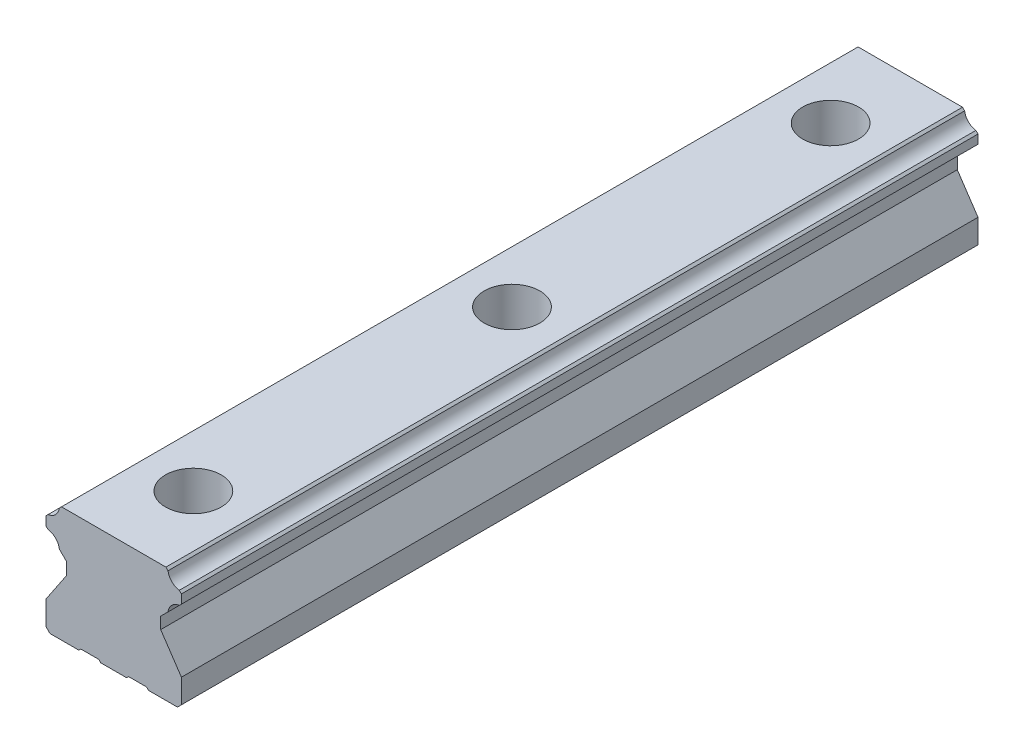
from build123d import *

# Parameters (mm, degrees)
BOSS_EXTRUDE1_DEPTH                                 = 200
CBORE_FOR_M8_HEX_SOCKET_HEAD_CAP_SCREW1_D           = 9
CBORE_FOR_M8_HEX_SOCKET_HEAD_CAP_SCREW1_CBORE_D     = 14
CBORE_FOR_M8_HEX_SOCKET_HEAD_CAP_SCREW1_CBORE_DEPTH = 12
LPATTERN1_COUNT                                     = 3
LPATTERN1_PITCH                                     = 80


with BuildPart() as part:
    # Sketch1 → Boss-Extrude1 (new body)
    with BuildSketch(Plane.XY):
        with BuildLine():
            Line((16.470618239, 25.639381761), (17, 25.11))
            Line((17, 25.11), (17, 22.88))
            Line((17, 22.88), (16.482146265, 22.362146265))
            ThreePointArc((16.482146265, 22.362146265), (14.576547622, 21.423452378), (13.637853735, 19.517853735))
            Line((13.637853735, 19.517853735), (11.8, 17.68))
            Line((11.8, 17.68), (11.8, 14.75))
            Line((11.8, 14.75), (17, 7))
            Line((17, 7), (17, 1))
            Line((17, 1), (16, 0))
            Line((16, 0), (8.75, 0))
            Line((8.75, 0), (8.25, 0.5))
            Line((8.25, 0.5), (3.75, 0.5))
            Line((3.75, 0.5), (3.25, 0))
            Line((3.25, 0), (-3.25, 0))
            Line((-3.25, 0), (-3.75, 0.5))
            Line((-3.75, 0.5), (-8.25, 0.5))
            Line((-8.25, 0.5), (-8.75, 0))
            Line((-8.75, 0), (-16, 0))
            Line((-16, 0), (-17, 1))
            Line((-17, 1), (-17, 7))
            Line((-17, 7), (-11.8, 14.75))
            Line((-11.8, 14.75), (-11.8, 17.68))
            Line((-11.8, 17.68), (-13.637853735, 19.517853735))
            ThreePointArc((-13.637853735, 19.517853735), (-14.576547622, 21.423452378), (-16.482146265, 22.362146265))
            Line((-16.482146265, 22.362146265), (-17, 22.88))
            Line((-17, 22.88), (-17, 25.11))
            Line((-17, 25.11), (-16.470618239, 25.639381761))
            ThreePointArc((-16.470618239, 25.639381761), (-14.576547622, 26.576547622), (-13.639381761, 28.470618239))
            Line((-13.639381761, 28.470618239), (-13.11, 29))
            Line((-13.11, 29), (13.11, 29))
            Line((13.11, 29), (13.639381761, 28.470618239))
            ThreePointArc((13.639381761, 28.470618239), (14.576547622, 26.576547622), (16.470618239, 25.639381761))
        make_face()
    extrude(amount=-BOSS_EXTRUDE1_DEPTH)

    # CBORE for M8 Hex Socket Head Cap Screw1 (through all)
    with Locations(Plane(origin=(0, 29, 0), x_dir=(1, 0, 0), z_dir=(0, 1, 0))):
        with Locations((0, 20)):
            cbore_for_m8_hex_socket_head_cap_screw1 = CounterBoreHole(CBORE_FOR_M8_HEX_SOCKET_HEAD_CAP_SCREW1_D / 2, CBORE_FOR_M8_HEX_SOCKET_HEAD_CAP_SCREW1_CBORE_D / 2, CBORE_FOR_M8_HEX_SOCKET_HEAD_CAP_SCREW1_CBORE_DEPTH)

    # LPattern1: CBORE for M8 Hex Socket Head Cap Screw1 ×3
    with Locations(*[(0, 0, -i * LPATTERN1_PITCH) for i in range(1, LPATTERN1_COUNT)]):
        add(cbore_for_m8_hex_socket_head_cap_screw1, mode=Mode.SUBTRACT)


solid = part.part
